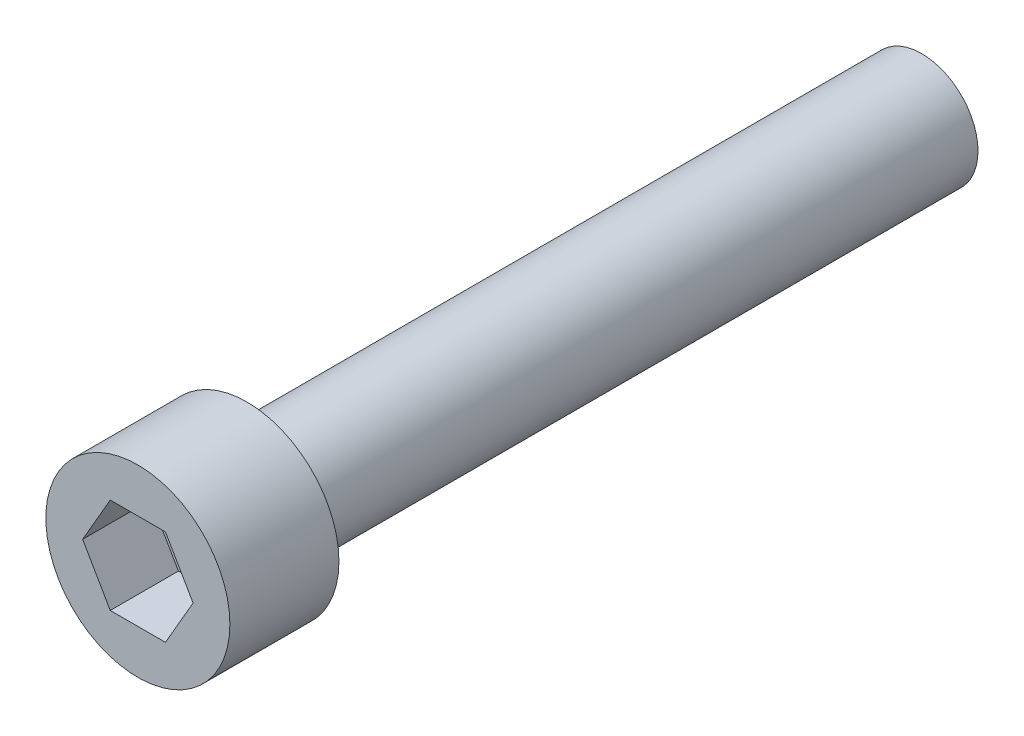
ISO-10303-21;
HEADER;
FILE_DESCRIPTION(('STEP AP214'),'2;1');
FILE_NAME('part.step','',(''),(''),'','','');
FILE_SCHEMA(('AUTOMOTIVE_DESIGN { 1 0 10303 214 1 1 1 1 }'));
ENDSEC;
DATA;
#1=APPLICATION_CONTEXT('core data for automotive mechanical design processes');
#2=APPLICATION_PROTOCOL_DEFINITION('international standard','automotive_design',2000,#1);
#3=PRODUCT_CONTEXT('',#1,'mechanical');
#4=PRODUCT('Part','Part','',(#3));
#5=PRODUCT_RELATED_PRODUCT_CATEGORY('part','',(#4));
#6=PRODUCT_DEFINITION_FORMATION('','',#4);
#7=PRODUCT_DEFINITION_CONTEXT('part definition',#1,'design');
#8=PRODUCT_DEFINITION('design','',#6,#7);
#9=PRODUCT_DEFINITION_SHAPE('','',#8);
#10=(LENGTH_UNIT() NAMED_UNIT(*) SI_UNIT(.MILLI.,.METRE.));
#11=(NAMED_UNIT(*) PLANE_ANGLE_UNIT() SI_UNIT($,.RADIAN.));
#12=(NAMED_UNIT(*) SI_UNIT($,.STERADIAN.) SOLID_ANGLE_UNIT());
#13=UNCERTAINTY_MEASURE_WITH_UNIT(LENGTH_MEASURE(1.E-05),#10,'distance_accuracy_value','');
#14=(GEOMETRIC_REPRESENTATION_CONTEXT(3) GLOBAL_UNCERTAINTY_ASSIGNED_CONTEXT((#13)) GLOBAL_UNIT_ASSIGNED_CONTEXT((#10,
#11,#12)) REPRESENTATION_CONTEXT('',''));
#15=CARTESIAN_POINT('',(0.,0.,0.));
#16=DIRECTION('',(0.,0.,1.));
#17=DIRECTION('',(1.,0.,0.));
#18=AXIS2_PLACEMENT_3D('',#15,#16,#17);
#19=CARTESIAN_POINT('',(0.,0.,4.064));
#20=DIRECTION('',(0.,0.,-1.));
#21=DIRECTION('',(-1.,0.,0.));
#22=AXIS2_PLACEMENT_3D('',#19,#20,#21);
#23=CYLINDRICAL_SURFACE('',#22,3.429);
#24=CARTESIAN_POINT('',(0.,0.,4.064));
#25=DIRECTION('',(0.,0.,1.));
#26=DIRECTION('',(1.,0.,0.));
#27=AXIS2_PLACEMENT_3D('',#24,#25,#26);
#28=CIRCLE('',#27,3.429);
#29=CARTESIAN_POINT('',(3.429,0.,4.064));
#30=VERTEX_POINT('',#29);
#31=EDGE_CURVE('E11',#30,#30,#28,.T.);
#32=ORIENTED_EDGE('',*,*,#31,.F.);
#33=EDGE_LOOP('',(#32));
#34=FACE_BOUND('',#33,.T.);
#35=CARTESIAN_POINT('',(0.,0.,0.));
#36=DIRECTION('',(0.,0.,1.));
#37=DIRECTION('',(1.,0.,0.));
#38=AXIS2_PLACEMENT_3D('',#35,#36,#37);
#39=CIRCLE('',#38,3.429);
#40=CARTESIAN_POINT('',(3.429,0.,0.));
#41=VERTEX_POINT('',#40);
#42=EDGE_CURVE('E40',#41,#41,#39,.T.);
#43=ORIENTED_EDGE('',*,*,#42,.T.);
#44=EDGE_LOOP('',(#43));
#45=FACE_BOUND('',#44,.T.);
#46=ADVANCED_FACE('F32',(#34,#45),#23,.T.);
#47=CARTESIAN_POINT('',(0.,0.,4.064));
#48=DIRECTION('',(0.,0.,1.));
#49=DIRECTION('',(1.,0.,0.));
#50=AXIS2_PLACEMENT_3D('',#47,#48,#49);
#51=PLANE('',#50);
#52=DIRECTION('',(0.5,0.866025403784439,0.));
#53=VECTOR('',#52,1.);
#54=CARTESIAN_POINT('',(1.0287,-1.7817606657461,4.064));
#55=LINE('',#54,#53);
#56=CARTESIAN_POINT('',(1.0287,-1.7817606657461,4.064));
#57=VERTEX_POINT('',#56);
#58=CARTESIAN_POINT('',(2.0574,0.,4.064));
#59=VERTEX_POINT('',#58);
#60=EDGE_CURVE('E48',#57,#59,#55,.T.);
#61=ORIENTED_EDGE('',*,*,#60,.F.);
#62=DIRECTION('',(1.,0.,0.));
#63=VECTOR('',#62,1.);
#64=CARTESIAN_POINT('',(-1.0287,-1.7817606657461,4.064));
#65=LINE('',#64,#63);
#66=CARTESIAN_POINT('',(-1.0287,-1.7817606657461,4.064));
#67=VERTEX_POINT('',#66);
#68=EDGE_CURVE('E131',#67,#57,#65,.T.);
#69=ORIENTED_EDGE('',*,*,#68,.F.);
#70=DIRECTION('',(0.5,-0.866025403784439,0.));
#71=VECTOR('',#70,1.);
#72=CARTESIAN_POINT('',(-2.0574,0.,4.064));
#73=LINE('',#72,#71);
#74=CARTESIAN_POINT('',(-2.0574,0.,4.064));
#75=VERTEX_POINT('',#74);
#76=EDGE_CURVE('E129',#75,#67,#73,.T.);
#77=ORIENTED_EDGE('',*,*,#76,.F.);
#78=DIRECTION('',(-0.5,-0.866025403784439,0.));
#79=VECTOR('',#78,1.);
#80=CARTESIAN_POINT('',(-1.0287,1.7817606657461,4.064));
#81=LINE('',#80,#79);
#82=CARTESIAN_POINT('',(-1.0287,1.7817606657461,4.064));
#83=VERTEX_POINT('',#82);
#84=EDGE_CURVE('E96',#83,#75,#81,.T.);
#85=ORIENTED_EDGE('',*,*,#84,.F.);
#86=DIRECTION('',(-1.,0.,0.));
#87=VECTOR('',#86,1.);
#88=CARTESIAN_POINT('',(1.0287,1.7817606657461,4.064));
#89=LINE('',#88,#87);
#90=CARTESIAN_POINT('',(1.0287,1.7817606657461,4.064));
#91=VERTEX_POINT('',#90);
#92=EDGE_CURVE('E125',#91,#83,#89,.T.);
#93=ORIENTED_EDGE('',*,*,#92,.F.);
#94=DIRECTION('',(-0.5,0.866025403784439,0.));
#95=VECTOR('',#94,1.);
#96=CARTESIAN_POINT('',(2.0574,0.,4.064));
#97=LINE('',#96,#95);
#98=EDGE_CURVE('E122',#59,#91,#97,.T.);
#99=ORIENTED_EDGE('',*,*,#98,.F.);
#100=EDGE_LOOP('',(#61,#69,#77,#85,#93,#99));
#101=FACE_BOUND('',#100,.T.);
#102=ORIENTED_EDGE('',*,*,#31,.T.);
#103=EDGE_LOOP('',(#102));
#104=FACE_BOUND('',#103,.T.);
#105=ADVANCED_FACE('F163',(#101,#104),#51,.T.);
#106=CARTESIAN_POINT('',(0.,0.,0.));
#107=DIRECTION('',(0.,0.,1.));
#108=DIRECTION('',(1.,0.,0.));
#109=AXIS2_PLACEMENT_3D('',#106,#107,#108);
#110=PLANE('',#109);
#111=CARTESIAN_POINT('',(0.,0.,0.));
#112=DIRECTION('',(0.,0.,1.));
#113=DIRECTION('',(1.,0.,0.));
#114=AXIS2_PLACEMENT_3D('',#111,#112,#113);
#115=CIRCLE('',#114,2.0955);
#116=CARTESIAN_POINT('',(2.0955,0.,0.));
#117=VERTEX_POINT('',#116);
#118=EDGE_CURVE('E35',#117,#117,#115,.T.);
#119=ORIENTED_EDGE('',*,*,#118,.T.);
#120=EDGE_LOOP('',(#119));
#121=FACE_BOUND('',#120,.T.);
#122=ORIENTED_EDGE('',*,*,#42,.F.);
#123=EDGE_LOOP('',(#122));
#124=FACE_BOUND('',#123,.T.);
#125=ADVANCED_FACE('F148',(#121,#124),#110,.F.);
#126=CARTESIAN_POINT('',(0.,0.,-25.146));
#127=DIRECTION('',(0.,0.,1.));
#128=DIRECTION('',(1.,0.,0.));
#129=AXIS2_PLACEMENT_3D('',#126,#127,#128);
#130=CYLINDRICAL_SURFACE('',#129,2.0955);
#131=CARTESIAN_POINT('',(0.,0.,-25.146));
#132=DIRECTION('',(0.,0.,1.));
#133=DIRECTION('',(1.,0.,0.));
#134=AXIS2_PLACEMENT_3D('',#131,#132,#133);
#135=CIRCLE('',#134,2.0955);
#136=CARTESIAN_POINT('',(2.0955,0.,-25.146));
#137=VERTEX_POINT('',#136);
#138=EDGE_CURVE('E135',#137,#137,#135,.T.);
#139=CARTESIAN_POINT('',(2.0955,0.,-25.146));
#140=CARTESIAN_POINT('',(2.0955,0.,-24.8840625));
#141=CARTESIAN_POINT('',(2.0955,0.,-24.622125));
#142=CARTESIAN_POINT('',(2.0955,0.,-24.09825));
#143=CARTESIAN_POINT('',(2.0955,0.,-23.8363125));
#144=CARTESIAN_POINT('',(2.0955,0.,-23.3124375));
#145=CARTESIAN_POINT('',(2.0955,0.,-23.0505));
#146=CARTESIAN_POINT('',(2.0955,0.,-22.526625));
#147=CARTESIAN_POINT('',(2.0955,0.,-22.2646875));
#148=CARTESIAN_POINT('',(2.0955,0.,-21.7408125));
#149=CARTESIAN_POINT('',(2.0955,0.,-21.478875));
#150=CARTESIAN_POINT('',(2.0955,0.,-20.955));
#151=CARTESIAN_POINT('',(2.0955,0.,-20.6930625));
#152=CARTESIAN_POINT('',(2.0955,0.,-20.1691875));
#153=CARTESIAN_POINT('',(2.0955,0.,-19.90725));
#154=CARTESIAN_POINT('',(2.0955,0.,-19.383375));
#155=CARTESIAN_POINT('',(2.0955,0.,-19.1214375));
#156=CARTESIAN_POINT('',(2.0955,0.,-18.5975625));
#157=CARTESIAN_POINT('',(2.0955,0.,-18.335625));
#158=CARTESIAN_POINT('',(2.0955,0.,-17.81175));
#159=CARTESIAN_POINT('',(2.0955,0.,-17.5498125));
#160=CARTESIAN_POINT('',(2.0955,0.,-17.0259375));
#161=CARTESIAN_POINT('',(2.0955,0.,-16.764));
#162=CARTESIAN_POINT('',(2.0955,0.,-16.240125));
#163=CARTESIAN_POINT('',(2.0955,0.,-15.9781875));
#164=CARTESIAN_POINT('',(2.0955,0.,-15.4543125));
#165=CARTESIAN_POINT('',(2.0955,0.,-15.192375));
#166=CARTESIAN_POINT('',(2.0955,0.,-14.6685));
#167=CARTESIAN_POINT('',(2.0955,0.,-14.4065625));
#168=CARTESIAN_POINT('',(2.0955,0.,-13.8826875));
#169=CARTESIAN_POINT('',(2.0955,0.,-13.62075));
#170=CARTESIAN_POINT('',(2.0955,0.,-13.096875));
#171=CARTESIAN_POINT('',(2.0955,0.,-12.8349375));
#172=CARTESIAN_POINT('',(2.0955,0.,-12.3110625));
#173=CARTESIAN_POINT('',(2.0955,0.,-12.049125));
#174=CARTESIAN_POINT('',(2.0955,0.,-11.52525));
#175=CARTESIAN_POINT('',(2.0955,0.,-11.2633125));
#176=CARTESIAN_POINT('',(2.0955,0.,-10.7394375));
#177=CARTESIAN_POINT('',(2.0955,0.,-10.4775));
#178=CARTESIAN_POINT('',(2.0955,0.,-9.953625));
#179=CARTESIAN_POINT('',(2.0955,0.,-9.6916875));
#180=CARTESIAN_POINT('',(2.0955,0.,-9.1678125));
#181=CARTESIAN_POINT('',(2.0955,0.,-8.905875));
#182=CARTESIAN_POINT('',(2.0955,0.,-8.382));
#183=CARTESIAN_POINT('',(2.0955,0.,-8.1200625));
#184=CARTESIAN_POINT('',(2.0955,0.,-7.5961875));
#185=CARTESIAN_POINT('',(2.0955,0.,-7.33425));
#186=CARTESIAN_POINT('',(2.0955,0.,-6.810375));
#187=CARTESIAN_POINT('',(2.0955,0.,-6.5484375));
#188=CARTESIAN_POINT('',(2.0955,0.,-6.0245625));
#189=CARTESIAN_POINT('',(2.0955,0.,-5.762625));
#190=CARTESIAN_POINT('',(2.0955,0.,-5.23875));
#191=CARTESIAN_POINT('',(2.0955,0.,-4.9768125));
#192=CARTESIAN_POINT('',(2.0955,0.,-4.4529375));
#193=CARTESIAN_POINT('',(2.0955,0.,-4.191));
#194=CARTESIAN_POINT('',(2.0955,0.,-3.667125));
#195=CARTESIAN_POINT('',(2.0955,0.,-3.4051875));
#196=CARTESIAN_POINT('',(2.0955,0.,-2.8813125));
#197=CARTESIAN_POINT('',(2.0955,0.,-2.619375));
#198=CARTESIAN_POINT('',(2.0955,0.,-2.0955));
#199=CARTESIAN_POINT('',(2.0955,0.,-1.8335625));
#200=CARTESIAN_POINT('',(2.0955,0.,-1.3096875));
#201=CARTESIAN_POINT('',(2.0955,0.,-1.04775));
#202=CARTESIAN_POINT('',(2.0955,0.,-0.523875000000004));
#203=CARTESIAN_POINT('',(2.0955,0.,-0.261937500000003));
#204=CARTESIAN_POINT('',(2.0955,0.,0.));
#205=B_SPLINE_CURVE_WITH_KNOTS('',3,(#139,#140,#141,#142,#143,#144,#145,#146,#147,#148,#149,
#150,#151,#152,#153,#154,#155,#156,#157,#158,#159,#160,#161,#162,#163,#164,#165,#166,#167,#168,
#169,#170,#171,#172,#173,#174,#175,#176,#177,#178,#179,#180,#181,#182,#183,#184,#185,#186,#187,
#188,#189,#190,#191,#192,#193,#194,#195,#196,#197,#198,#199,#200,#201,#202,#203,#204),
.UNSPECIFIED.,.F.,.F.,(4,2,2,2,2,2,2,2,2,2,2,2,2,2,2,2,2,2,2,2,2,2,2,2,2,2,2,2,2,2,2,2,4),(0.,
0.785812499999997,1.571625,2.3574375,3.14325,3.9290625,4.714875,5.5006875,6.2865,7.0723125,
7.85812499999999,8.6439375,9.42974999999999,10.2155625,11.001375,11.7871875,12.573,13.3588125,
14.144625,14.9304375,15.71625,16.5020625,17.287875,18.0736875,18.8595,19.6453125,20.431125,
21.2169375,22.00275,22.7885625,23.574375,24.3601875,25.146),.UNSPECIFIED.);
#206=EDGE_CURVE('BSEAM151',#137,#117,#205,.T.);
#207=ORIENTED_EDGE('',*,*,#138,.T.);
#208=ORIENTED_EDGE('',*,*,#118,.F.);
#209=ORIENTED_EDGE('',*,*,#206,.T.);
#210=ORIENTED_EDGE('',*,*,#206,.F.);
#211=EDGE_LOOP('',(#207,#209,#208,#210));
#212=FACE_BOUND('',#211,.T.);
#213=ADVANCED_FACE('F151',(#212),#130,.T.);
#214=CARTESIAN_POINT('',(0.,0.,-25.146));
#215=DIRECTION('',(0.,0.,1.));
#216=DIRECTION('',(1.,0.,0.));
#217=AXIS2_PLACEMENT_3D('',#214,#215,#216);
#218=PLANE('',#217);
#219=ORIENTED_EDGE('',*,*,#138,.F.);
#220=EDGE_LOOP('',(#219));
#221=FACE_BOUND('',#220,.T.);
#222=ADVANCED_FACE('F153',(#221),#218,.F.);
#223=CARTESIAN_POINT('',(1.0287,-1.7817606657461,1.524));
#224=DIRECTION('',(0.866025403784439,-0.5,0.));
#225=DIRECTION('',(0.5,0.866025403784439,0.));
#226=AXIS2_PLACEMENT_3D('',#223,#224,#225);
#227=PLANE('',#226);
#228=ORIENTED_EDGE('',*,*,#60,.T.);
#229=DIRECTION('',(0.,0.,1.));
#230=VECTOR('',#229,1.);
#231=CARTESIAN_POINT('',(2.0574,0.,1.524));
#232=LINE('',#231,#230);
#233=CARTESIAN_POINT('',(2.0574,0.,1.524));
#234=VERTEX_POINT('',#233);
#235=EDGE_CURVE('E78',#234,#59,#232,.T.);
#236=ORIENTED_EDGE('',*,*,#235,.F.);
#237=DIRECTION('',(0.5,0.866025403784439,0.));
#238=VECTOR('',#237,1.);
#239=CARTESIAN_POINT('',(1.0287,-1.7817606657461,1.524));
#240=LINE('',#239,#238);
#241=CARTESIAN_POINT('',(1.0287,-1.7817606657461,1.524));
#242=VERTEX_POINT('',#241);
#243=EDGE_CURVE('E133',#242,#234,#240,.T.);
#244=ORIENTED_EDGE('',*,*,#243,.F.);
#245=DIRECTION('',(0.,0.,1.));
#246=VECTOR('',#245,1.);
#247=CARTESIAN_POINT('',(1.0287,-1.7817606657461,1.524));
#248=LINE('',#247,#246);
#249=EDGE_CURVE('E56',#242,#57,#248,.T.);
#250=ORIENTED_EDGE('',*,*,#249,.T.);
#251=EDGE_LOOP('',(#228,#236,#244,#250));
#252=FACE_BOUND('',#251,.T.);
#253=ADVANCED_FACE('F160',(#252),#227,.F.);
#254=CARTESIAN_POINT('',(-1.0287,-1.7817606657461,1.524));
#255=DIRECTION('',(0.,-1.,0.));
#256=DIRECTION('',(1.,0.,0.));
#257=AXIS2_PLACEMENT_3D('',#254,#255,#256);
#258=PLANE('',#257);
#259=ORIENTED_EDGE('',*,*,#68,.T.);
#260=ORIENTED_EDGE('',*,*,#249,.F.);
#261=DIRECTION('',(1.,0.,0.));
#262=VECTOR('',#261,1.);
#263=CARTESIAN_POINT('',(-1.0287,-1.7817606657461,1.524));
#264=LINE('',#263,#262);
#265=CARTESIAN_POINT('',(-1.0287,-1.7817606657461,1.524));
#266=VERTEX_POINT('',#265);
#267=EDGE_CURVE('E108',#266,#242,#264,.T.);
#268=ORIENTED_EDGE('',*,*,#267,.F.);
#269=DIRECTION('',(0.,0.,1.));
#270=VECTOR('',#269,1.);
#271=CARTESIAN_POINT('',(-1.0287,-1.7817606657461,1.524));
#272=LINE('',#271,#270);
#273=EDGE_CURVE('E100',#266,#67,#272,.T.);
#274=ORIENTED_EDGE('',*,*,#273,.T.);
#275=EDGE_LOOP('',(#259,#260,#268,#274));
#276=FACE_BOUND('',#275,.T.);
#277=ADVANCED_FACE('F182',(#276),#258,.F.);
#278=CARTESIAN_POINT('',(-2.0574,0.,1.524));
#279=DIRECTION('',(-0.866025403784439,-0.5,0.));
#280=DIRECTION('',(0.5,-0.866025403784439,0.));
#281=AXIS2_PLACEMENT_3D('',#278,#279,#280);
#282=PLANE('',#281);
#283=ORIENTED_EDGE('',*,*,#76,.T.);
#284=ORIENTED_EDGE('',*,*,#273,.F.);
#285=DIRECTION('',(0.5,-0.866025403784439,0.));
#286=VECTOR('',#285,1.);
#287=CARTESIAN_POINT('',(-2.0574,0.,1.524));
#288=LINE('',#287,#286);
#289=CARTESIAN_POINT('',(-2.0574,0.,1.524));
#290=VERTEX_POINT('',#289);
#291=EDGE_CURVE('E104',#290,#266,#288,.T.);
#292=ORIENTED_EDGE('',*,*,#291,.F.);
#293=DIRECTION('',(0.,0.,1.));
#294=VECTOR('',#293,1.);
#295=CARTESIAN_POINT('',(-2.0574,0.,1.524));
#296=LINE('',#295,#294);
#297=EDGE_CURVE('E89',#290,#75,#296,.T.);
#298=ORIENTED_EDGE('',*,*,#297,.T.);
#299=EDGE_LOOP('',(#283,#284,#292,#298));
#300=FACE_BOUND('',#299,.T.);
#301=ADVANCED_FACE('F105',(#300),#282,.F.);
#302=CARTESIAN_POINT('',(-1.0287,1.7817606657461,1.524));
#303=DIRECTION('',(-0.866025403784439,0.5,0.));
#304=DIRECTION('',(-0.5,-0.866025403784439,0.));
#305=AXIS2_PLACEMENT_3D('',#302,#303,#304);
#306=PLANE('',#305);
#307=ORIENTED_EDGE('',*,*,#84,.T.);
#308=ORIENTED_EDGE('',*,*,#297,.F.);
#309=DIRECTION('',(-0.5,-0.866025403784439,0.));
#310=VECTOR('',#309,1.);
#311=CARTESIAN_POINT('',(-1.0287,1.7817606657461,1.524));
#312=LINE('',#311,#310);
#313=CARTESIAN_POINT('',(-1.0287,1.7817606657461,1.524));
#314=VERTEX_POINT('',#313);
#315=EDGE_CURVE('E93',#314,#290,#312,.T.);
#316=ORIENTED_EDGE('',*,*,#315,.F.);
#317=DIRECTION('',(0.,0.,1.));
#318=VECTOR('',#317,1.);
#319=CARTESIAN_POINT('',(-1.0287,1.7817606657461,1.524));
#320=LINE('',#319,#318);
#321=EDGE_CURVE('E101',#314,#83,#320,.T.);
#322=ORIENTED_EDGE('',*,*,#321,.T.);
#323=EDGE_LOOP('',(#307,#308,#316,#322));
#324=FACE_BOUND('',#323,.T.);
#325=ADVANCED_FACE('F91',(#324),#306,.F.);
#326=CARTESIAN_POINT('',(1.0287,1.7817606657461,1.524));
#327=DIRECTION('',(0.,1.,0.));
#328=DIRECTION('',(0.,0.,1.));
#329=AXIS2_PLACEMENT_3D('',#326,#327,#328);
#330=PLANE('',#329);
#331=ORIENTED_EDGE('',*,*,#92,.T.);
#332=ORIENTED_EDGE('',*,*,#321,.F.);
#333=DIRECTION('',(-1.,0.,0.));
#334=VECTOR('',#333,1.);
#335=CARTESIAN_POINT('',(1.0287,1.7817606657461,1.524));
#336=LINE('',#335,#334);
#337=CARTESIAN_POINT('',(1.0287,1.7817606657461,1.524));
#338=VERTEX_POINT('',#337);
#339=EDGE_CURVE('E114',#338,#314,#336,.T.);
#340=ORIENTED_EDGE('',*,*,#339,.F.);
#341=DIRECTION('',(0.,0.,1.));
#342=VECTOR('',#341,1.);
#343=CARTESIAN_POINT('',(1.0287,1.7817606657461,1.524));
#344=LINE('',#343,#342);
#345=EDGE_CURVE('E138',#338,#91,#344,.T.);
#346=ORIENTED_EDGE('',*,*,#345,.T.);
#347=EDGE_LOOP('',(#331,#332,#340,#346));
#348=FACE_BOUND('',#347,.T.);
#349=ADVANCED_FACE('F191',(#348),#330,.F.);
#350=CARTESIAN_POINT('',(2.0574,0.,1.524));
#351=DIRECTION('',(0.866025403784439,0.5,0.));
#352=DIRECTION('',(-0.5,0.866025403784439,0.));
#353=AXIS2_PLACEMENT_3D('',#350,#351,#352);
#354=PLANE('',#353);
#355=ORIENTED_EDGE('',*,*,#98,.T.);
#356=ORIENTED_EDGE('',*,*,#345,.F.);
#357=DIRECTION('',(-0.5,0.866025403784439,0.));
#358=VECTOR('',#357,1.);
#359=CARTESIAN_POINT('',(2.0574,0.,1.524));
#360=LINE('',#359,#358);
#361=EDGE_CURVE('E116',#234,#338,#360,.T.);
#362=ORIENTED_EDGE('',*,*,#361,.F.);
#363=ORIENTED_EDGE('',*,*,#235,.T.);
#364=EDGE_LOOP('',(#355,#356,#362,#363));
#365=FACE_BOUND('',#364,.T.);
#366=ADVANCED_FACE('F179',(#365),#354,.F.);
#367=CARTESIAN_POINT('',(0.,0.,1.524));
#368=DIRECTION('',(0.,0.,1.));
#369=DIRECTION('',(1.,0.,0.));
#370=AXIS2_PLACEMENT_3D('',#367,#368,#369);
#371=PLANE('',#370);
#372=ORIENTED_EDGE('',*,*,#243,.T.);
#373=ORIENTED_EDGE('',*,*,#361,.T.);
#374=ORIENTED_EDGE('',*,*,#339,.T.);
#375=ORIENTED_EDGE('',*,*,#315,.T.);
#376=ORIENTED_EDGE('',*,*,#291,.T.);
#377=ORIENTED_EDGE('',*,*,#267,.T.);
#378=EDGE_LOOP('',(#372,#373,#374,#375,#376,#377));
#379=FACE_BOUND('',#378,.T.);
#380=ADVANCED_FACE('F111',(#379),#371,.T.);
#381=CLOSED_SHELL('',(#46,#105,#125,#213,#222,#253,#277,#301,#325,#349,#366,#380));
#382=MANIFOLD_SOLID_BREP('B2',#381);
#383=ADVANCED_BREP_SHAPE_REPRESENTATION('',(#18,#382),#14);
#384=SHAPE_DEFINITION_REPRESENTATION(#9,#383);
ENDSEC;
END-ISO-10303-21;
